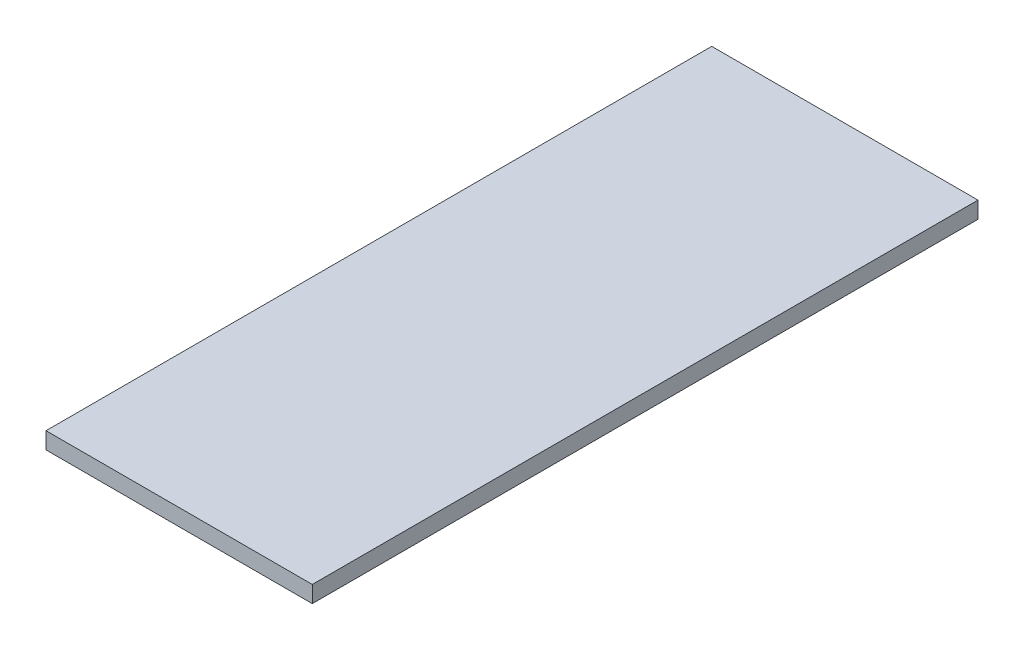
from build123d import *

# Parameters (mm, degrees)
ESQUISSE1_W          = 80
ESQUISSE1_H          = 5
BASE_EXTRUSION_DEPTH = 200


with BuildPart() as part:
    # Esquisse1 → Base-Extrusion (new body)
    with BuildSketch(Plane.XY):
        with Locations((40, -2.5)):
            Rectangle(ESQUISSE1_W, ESQUISSE1_H)
    extrude(amount=BASE_EXTRUSION_DEPTH)


solid = part.part
